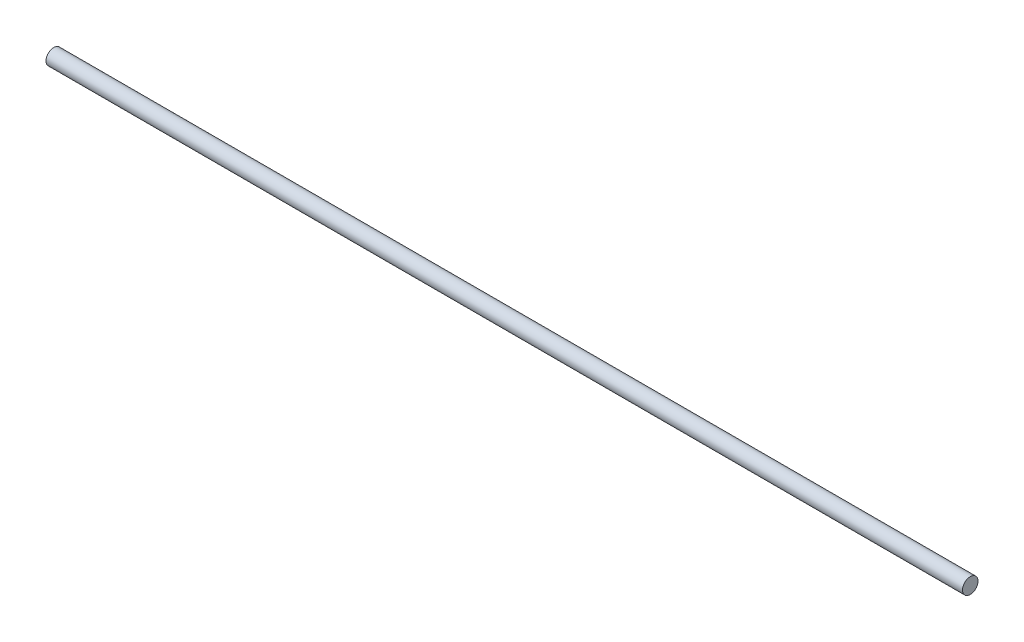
ISO-10303-21;
HEADER;
FILE_DESCRIPTION(('STEP AP214'),'2;1');
FILE_NAME('part.step','',(''),(''),'','','');
FILE_SCHEMA(('AUTOMOTIVE_DESIGN { 1 0 10303 214 1 1 1 1 }'));
ENDSEC;
DATA;
#1=APPLICATION_CONTEXT('core data for automotive mechanical design processes');
#2=APPLICATION_PROTOCOL_DEFINITION('international standard','automotive_design',2000,#1);
#3=PRODUCT_CONTEXT('',#1,'mechanical');
#4=PRODUCT('Part','Part','',(#3));
#5=PRODUCT_RELATED_PRODUCT_CATEGORY('part','',(#4));
#6=PRODUCT_DEFINITION_FORMATION('','',#4);
#7=PRODUCT_DEFINITION_CONTEXT('part definition',#1,'design');
#8=PRODUCT_DEFINITION('design','',#6,#7);
#9=PRODUCT_DEFINITION_SHAPE('','',#8);
#10=(LENGTH_UNIT() NAMED_UNIT(*) SI_UNIT(.MILLI.,.METRE.));
#11=(NAMED_UNIT(*) PLANE_ANGLE_UNIT() SI_UNIT($,.RADIAN.));
#12=(NAMED_UNIT(*) SI_UNIT($,.STERADIAN.) SOLID_ANGLE_UNIT());
#13=UNCERTAINTY_MEASURE_WITH_UNIT(LENGTH_MEASURE(1.E-05),#10,'distance_accuracy_value','');
#14=(GEOMETRIC_REPRESENTATION_CONTEXT(3) GLOBAL_UNCERTAINTY_ASSIGNED_CONTEXT((#13)) GLOBAL_UNIT_ASSIGNED_CONTEXT((#10,
#11,#12)) REPRESENTATION_CONTEXT('',''));
#15=CARTESIAN_POINT('',(0.,0.,0.));
#16=DIRECTION('',(0.,0.,1.));
#17=DIRECTION('',(1.,0.,0.));
#18=AXIS2_PLACEMENT_3D('',#15,#16,#17);
#19=CARTESIAN_POINT('',(331.760074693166,0.,0.));
#20=DIRECTION('',(1.,0.,0.));
#21=DIRECTION('',(0.,0.,-1.));
#22=AXIS2_PLACEMENT_3D('',#19,#20,#21);
#23=PLANE('',#22);
#24=CARTESIAN_POINT('',(331.760074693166,0.,0.));
#25=DIRECTION('',(-1.,0.,0.));
#26=DIRECTION('',(0.,0.,1.));
#27=AXIS2_PLACEMENT_3D('',#24,#25,#26);
#28=CIRCLE('',#27,5.50000000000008);
#29=CARTESIAN_POINT('',(331.760074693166,0.,5.50000000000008));
#30=VERTEX_POINT('',#29);
#31=EDGE_CURVE('E37',#30,#30,#28,.T.);
#32=ORIENTED_EDGE('',*,*,#31,.F.);
#33=EDGE_LOOP('',(#32));
#34=FACE_BOUND('',#33,.T.);
#35=ADVANCED_FACE('F31',(#34),#23,.T.);
#36=CARTESIAN_POINT('',(-317.951374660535,0.,0.));
#37=DIRECTION('',(-1.,0.,0.));
#38=DIRECTION('',(0.,0.,1.));
#39=AXIS2_PLACEMENT_3D('',#36,#37,#38);
#40=PLANE('',#39);
#41=CARTESIAN_POINT('',(-317.951374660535,0.,0.));
#42=DIRECTION('',(-1.,0.,0.));
#43=DIRECTION('',(0.,0.,1.));
#44=AXIS2_PLACEMENT_3D('',#41,#42,#43);
#45=CIRCLE('',#44,5.50000000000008);
#46=CARTESIAN_POINT('',(-317.951374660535,0.,5.50000000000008));
#47=VERTEX_POINT('',#46);
#48=EDGE_CURVE('E10',#47,#47,#45,.T.);
#49=ORIENTED_EDGE('',*,*,#48,.T.);
#50=EDGE_LOOP('',(#49));
#51=FACE_BOUND('',#50,.T.);
#52=ADVANCED_FACE('F47',(#51),#40,.T.);
#53=CARTESIAN_POINT('',(-430.529566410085,0.,0.));
#54=DIRECTION('',(-1.,0.,0.));
#55=DIRECTION('',(0.,0.,1.));
#56=AXIS2_PLACEMENT_3D('',#53,#54,#55);
#57=CYLINDRICAL_SURFACE('',#56,5.50000000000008);
#58=ORIENTED_EDGE('',*,*,#31,.T.);
#59=EDGE_LOOP('',(#58));
#60=FACE_BOUND('',#59,.T.);
#61=ORIENTED_EDGE('',*,*,#48,.F.);
#62=EDGE_LOOP('',(#61));
#63=FACE_BOUND('',#62,.T.);
#64=ADVANCED_FACE('F43',(#60,#63),#57,.T.);
#65=CLOSED_SHELL('',(#35,#52,#64));
#66=MANIFOLD_SOLID_BREP('B2',#65);
#67=ADVANCED_BREP_SHAPE_REPRESENTATION('',(#18,#66),#14);
#68=SHAPE_DEFINITION_REPRESENTATION(#9,#67);
ENDSEC;
END-ISO-10303-21;
